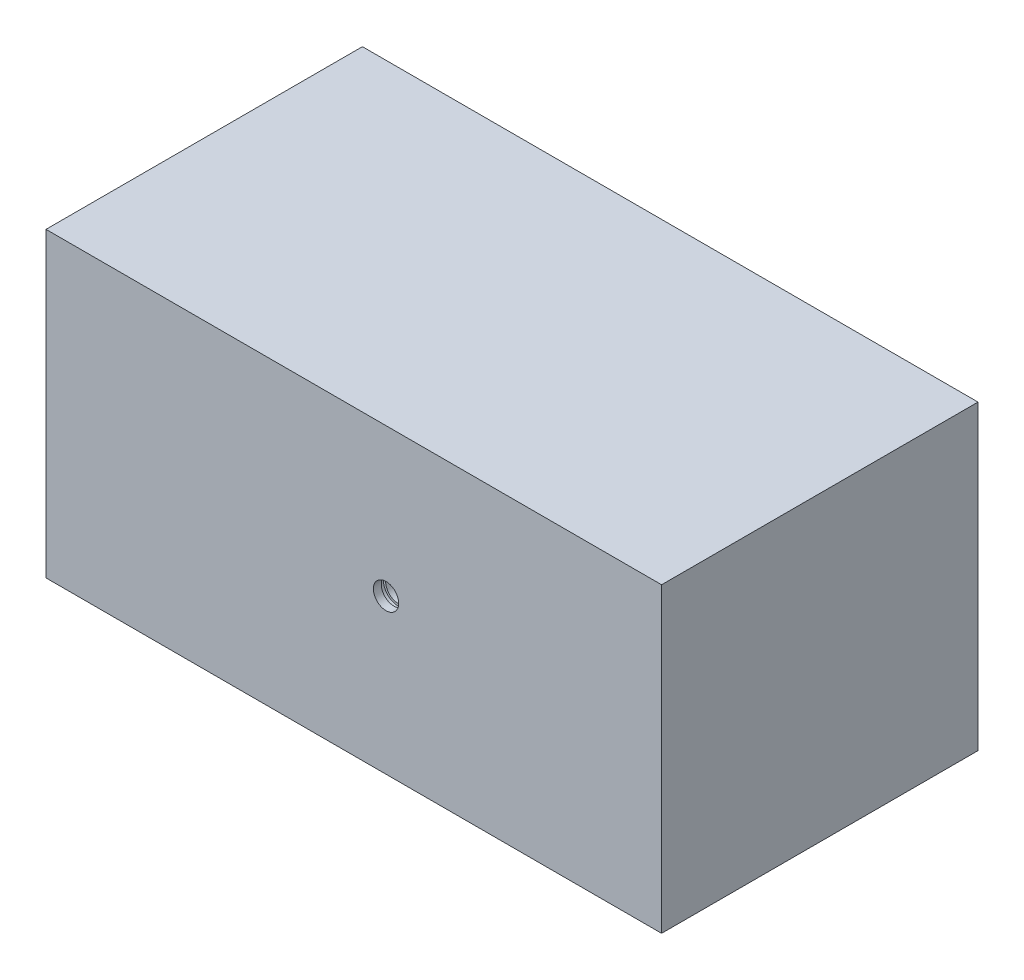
from build123d import *

# Parameters (mm, degrees)
SKIZZE1_W                          = 97.275855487
SKIZZE1_H                          = 47.705176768
LINEAR_AUSTRAGEN1_DEPTH            = 50
F_4_0_4_DURCHMESSER_BOHRUNG1_D     = 4
F_4_0_4_DURCHMESSER_BOHRUNG1_DEPTH = 14
F_4_0_4_DURCHMESSER_BOHRUNG1_TIP   = 1.201721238
SKIZZE3_W                          = 0.69321248
SKIZZE3_H                          = 0.692995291


with BuildPart() as part:
    # Skizze1 → Linear austragen1 (new body)
    with BuildSketch(Plane.XY):
        with Locations((48.637927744, 23.852588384)):
            Rectangle(SKIZZE1_W, SKIZZE1_H)
    extrude(amount=LINEAR_AUSTRAGEN1_DEPTH)

    # 4.0 _4_ Durchmesser Bohrung1
    with Locations(Plane(origin=(53.72865514, 24.382542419, 50), x_dir=(1, 0, 0), z_dir=(0, 0, 1))):
        with Locations((0, 0)):
            Hole(F_4_0_4_DURCHMESSER_BOHRUNG1_D / 2, depth=F_4_0_4_DURCHMESSER_BOHRUNG1_DEPTH)
            with Locations((0, 0, -(F_4_0_4_DURCHMESSER_BOHRUNG1_DEPTH + F_4_0_4_DURCHMESSER_BOHRUNG1_TIP / 2))):  # 118° drill point
                Cone(0, F_4_0_4_DURCHMESSER_BOHRUNG1_D / 2, F_4_0_4_DURCHMESSER_BOHRUNG1_TIP, mode=Mode.SUBTRACT)

    # Skizze3 → Schnitt-Rotation1 (revolve, cut)
    with BuildSketch(Plane(origin=(53.72865514, 0, 0), x_dir=(0, 0, -1), z_dir=(1, 0, 0)), mode=Mode.PRIVATE) as schnitt_rotation1_sk:
        with Locations((-48.405650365, 26.385600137)):
            Rectangle(SKIZZE3_W, SKIZZE3_H)
    revolve(schnitt_rotation1_sk.sketch.rotate(Axis((53.72865514, 24.382542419, 50), (0, 0, 1)), 270), axis=Axis((53.72865514, 24.382542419, 50), (0, 0, 1)), mode=Mode.SUBTRACT)


solid = part.part
